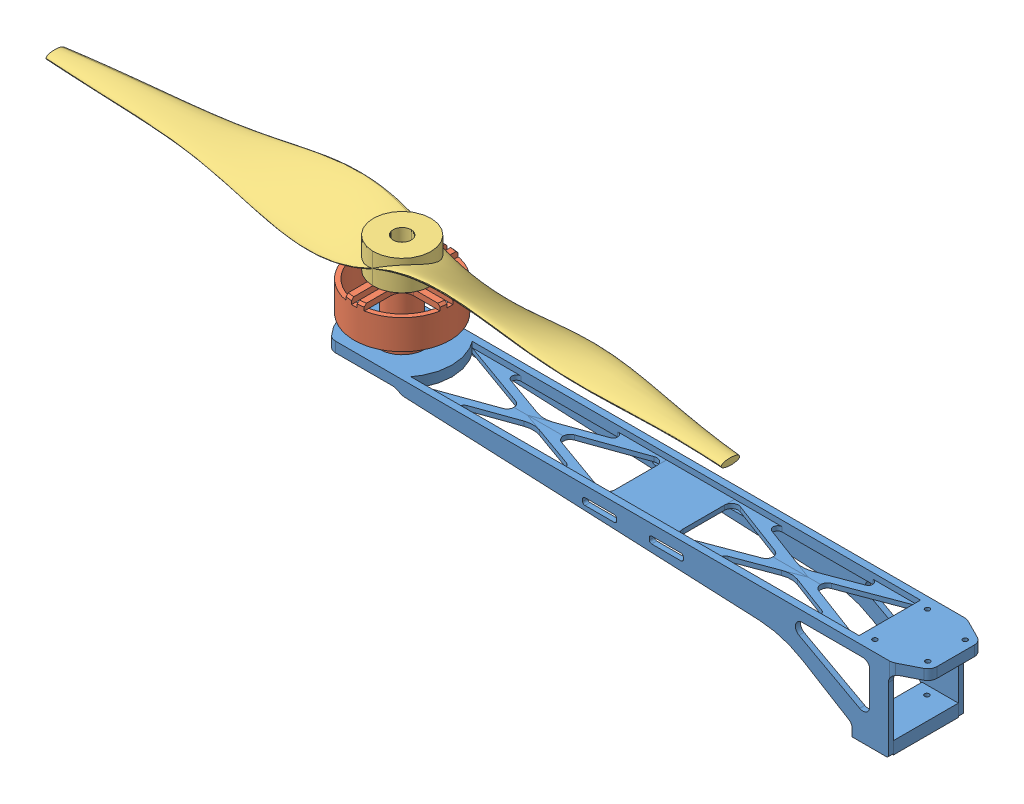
SolidWorks assembly Arm_CW.SLDASM, configuration Default (file format 10000). Lengths in mm.
Overall size (396.67 77.44 42.2).
3 component instances, 3 part files, 5 mates.
Components (placement in the parent):
- x55_Arm_Modified-1: x55_Arm_Modified.SLDPRT [Default] at (62.8208 119.6412 236.4477) size (266 37.25 33.07)
- Motor-1: Motor.SLDPRT [Default] at (-22.3868 325.158 463.3907) x (0 0 1) z (0 -1 0) size (42.2 42.2 36.5)
- prop_12x6-Mirror-1: prop_12x6-Mirror.SLDPRT [Default] at (-22.3868 392.762 463.3907) x (0.02311 0 -0.999733) z (0 -1 0) size (26.56 304.8 16.16)
Mates (geometry in assembly coordinates):
- Concentric1: concentric aligned: cylinder of x55_Arm_Modified-1 through (-22.3868 300.658 463.3907) axis (0 1 0) radius 5; cylinder of Motor-1 through (-22.3868 298.658 463.3907) axis (0 1 0) radius 2
- Coincident1: coincident anti-aligned: plane of x55_Arm_Modified-1 through (-22.3868 300.658 463.3907) normal (0 1 0); plane of Motor-1 through (-22.3868 300.658 463.3907) normal (0 -1 0)
- Parallel1: parallel aligned: plane of x55_Arm_Modified-1 through (-68.1054 300.908 479.9282) normal (0 0 1); plane of Motor-1 through (-18.3868 322.658 467.3933) normal (0 0 1)
- Concentric3: concentric anti-aligned: cylinder of Motor-1 through (-22.3868 335.158 463.3907) axis (0 -1 0) radius 2; cylinder of prop_12x6-Mirror-1 through (-22.3868 339.366 463.3907) axis (0 1 0) radius 4
- Distance2: distance = 1 mm anti-aligned: plane of prop_12x6-Mirror-1 through (-22.3868 326.158 463.3907) normal (0 -1 0); plane of Motor-1 through (-22.3868 325.158 463.3907) normal (0 1 0)
